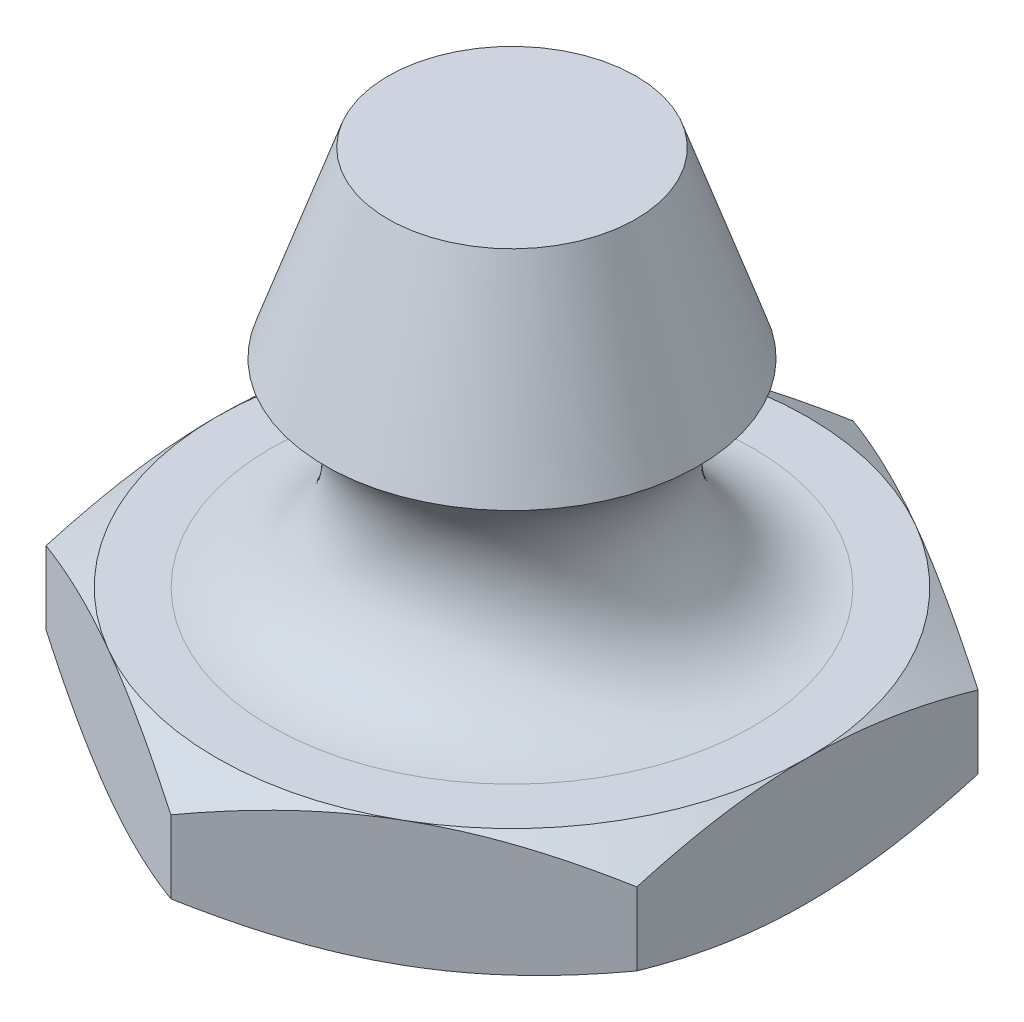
from build123d import *

# Parameters (mm, degrees)
BASE_EXTRUDE_DEPTH = 9.525


with BuildPart() as part:
    # Sketch1 → Base-Extrude (new body)
    with BuildSketch(Plane(origin=(0, 0, 0), x_dir=(1, 0, 0), z_dir=(0, 1, 0))):
        Polygon((-5.55625, 3.207902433), (-5.55625, -3.207902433), (0, -6.415804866), (5.55625, -3.207902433), (5.55625, 3.207902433), (0, 6.415804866), align=None)
    extrude(amount=BASE_EXTRUDE_DEPTH)

    # Sketch2 → Cut-Revolve2 (revolve, cut)
    with BuildSketch(Plane.XY, mode=Mode.PRIVATE) as cut_revolve2_sk:
        with BuildLine():
            Line((-2.331817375, 9.525), (-3.512516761, 6.096))
            ThreePointArc((-3.512516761, 6.096), (-2.59841, 3.839345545), (-4.5339, 2.3622))
            Line((-4.5339, 2.3622), (-9.494617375, 2.3622))
            Line((-9.494617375, 2.3622), (-9.494617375, 9.525))
            Line((-9.494617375, 9.525), (-2.331817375, 9.525))
        make_face()
    revolve(cut_revolve2_sk.sketch.rotate(Axis((0, 0.697454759, 0), (0, 1, 0)), 270), axis=Axis((0, 0.697454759, 0), (0, 1, 0)), mode=Mode.SUBTRACT)

    # Sketch4 → Cut-Revolve3 (revolve, cut)
    with BuildSketch(Plane.XY, mode=Mode.PRIVATE) as cut_revolve3_sk:
        Polygon((-5.55625, 2.3622), (-7.91845, 2.3622), (-7.91845, 0), (-5.55625, 0), (-7.601975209, 1.1811), align=None)
    revolve(cut_revolve3_sk.sketch.rotate(Axis((0, 4.739586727, 0), (0, -1, 0)), 90), axis=Axis((0, 4.739586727, 0), (0, -1, 0)), mode=Mode.SUBTRACT)


solid = part.part
